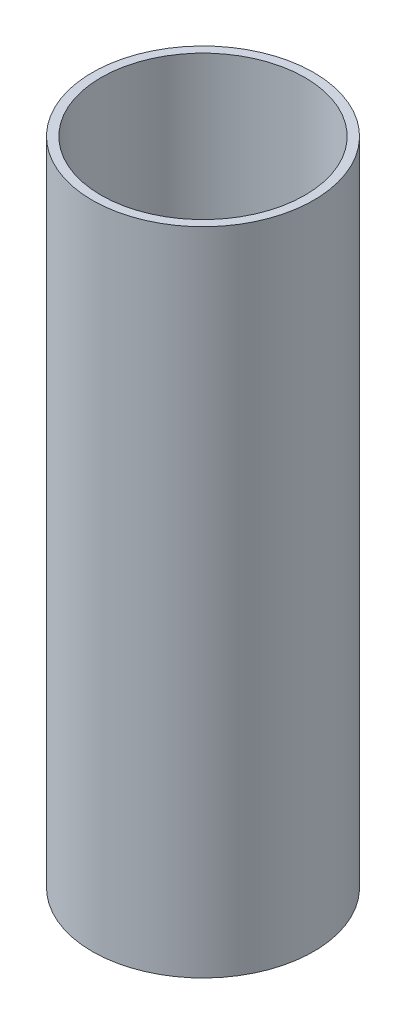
from build123d import *

# Parameters (mm, degrees)
SKETCH1_R           = 37.846
SKETCH1_R_2         = 34.8615
BOSS_EXTRUDE1_DEPTH = 222.43542


with BuildPart() as part:
    # Sketch1 → Boss-Extrude1 (new body)
    with BuildSketch(Plane(origin=(0, 0, 0), x_dir=(1, 0, 0), z_dir=(0, 1, 0))):
        with Locations(Location((0, 0, 0), (0, 0, 270))):
            Circle(SKETCH1_R)
        with Locations(Location((0, 0, 0), (0, 0, 270))):
            Circle(SKETCH1_R_2, mode=Mode.SUBTRACT)
    extrude(amount=BOSS_EXTRUDE1_DEPTH)


solid = part.part
